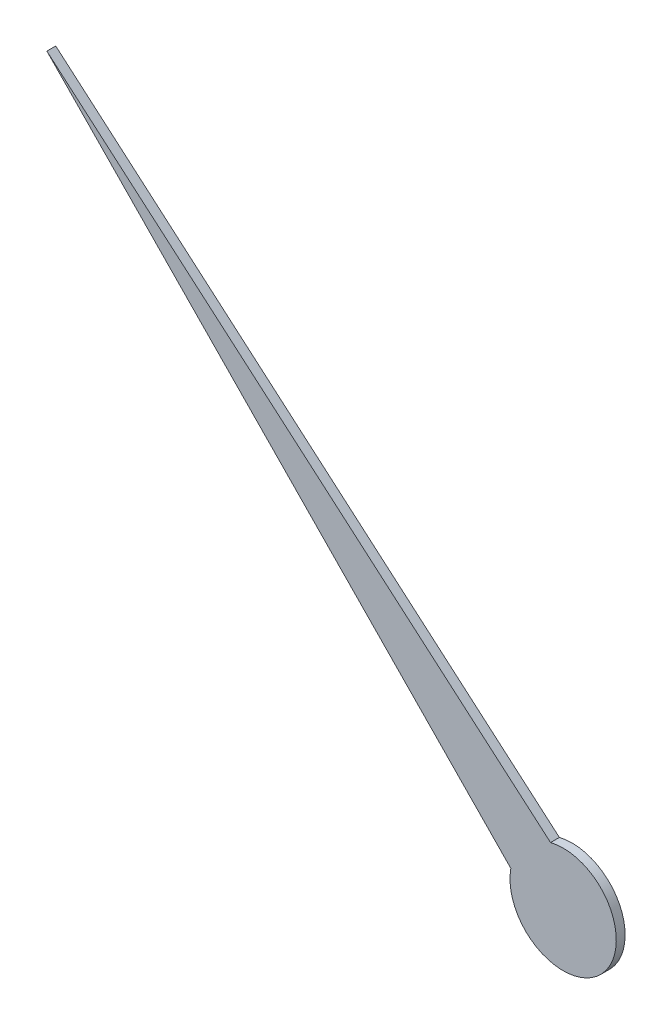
from build123d import *

# Parameters (mm, degrees)
LINEAR_AUSTRAGEN4_DEPTH = 0.25


with BuildPart() as part:
    # Skizze7 → Linear austragen4 (new body)
    with BuildSketch(Plane.XY):
        with BuildLine():
            Line((-14.573915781, 13.696750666), (-1.476477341, 0.264602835))
            ThreePointArc((-1.476477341, 0.264602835), (1.093043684, -1.0272563), (-0.355628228, 1.457233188))
            Line((-0.355628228, 1.457233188), (-14.573915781, 13.696750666))
        make_face()
    extrude(amount=LINEAR_AUSTRAGEN4_DEPTH)


solid = part.part
